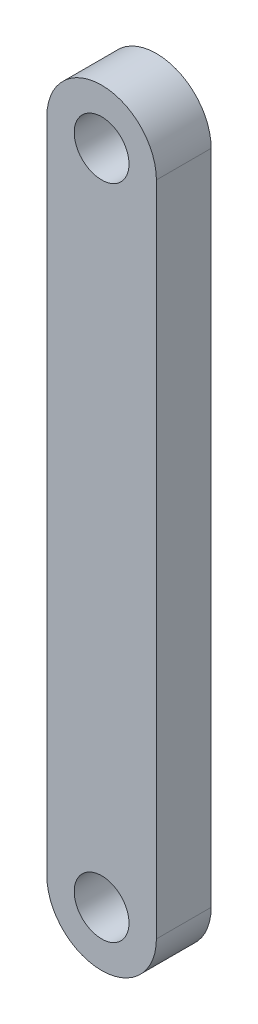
ISO-10303-21;
HEADER;
FILE_DESCRIPTION(('STEP AP214'),'2;1');
FILE_NAME('part.step','',(''),(''),'','','');
FILE_SCHEMA(('AUTOMOTIVE_DESIGN { 1 0 10303 214 1 1 1 1 }'));
ENDSEC;
DATA;
#1=APPLICATION_CONTEXT('core data for automotive mechanical design processes');
#2=APPLICATION_PROTOCOL_DEFINITION('international standard','automotive_design',2000,#1);
#3=PRODUCT_CONTEXT('',#1,'mechanical');
#4=PRODUCT('Part','Part','',(#3));
#5=PRODUCT_RELATED_PRODUCT_CATEGORY('part','',(#4));
#6=PRODUCT_DEFINITION_FORMATION('','',#4);
#7=PRODUCT_DEFINITION_CONTEXT('part definition',#1,'design');
#8=PRODUCT_DEFINITION('design','',#6,#7);
#9=PRODUCT_DEFINITION_SHAPE('','',#8);
#10=(LENGTH_UNIT() NAMED_UNIT(*) SI_UNIT(.MILLI.,.METRE.));
#11=(NAMED_UNIT(*) PLANE_ANGLE_UNIT() SI_UNIT($,.RADIAN.));
#12=(NAMED_UNIT(*) SI_UNIT($,.STERADIAN.) SOLID_ANGLE_UNIT());
#13=UNCERTAINTY_MEASURE_WITH_UNIT(LENGTH_MEASURE(1.E-05),#10,'distance_accuracy_value','');
#14=(GEOMETRIC_REPRESENTATION_CONTEXT(3) GLOBAL_UNCERTAINTY_ASSIGNED_CONTEXT((#13)) GLOBAL_UNIT_ASSIGNED_CONTEXT((#10,
#11,#12)) REPRESENTATION_CONTEXT('',''));
#15=CARTESIAN_POINT('',(0.,0.,0.));
#16=DIRECTION('',(0.,0.,1.));
#17=DIRECTION('',(1.,0.,0.));
#18=AXIS2_PLACEMENT_3D('',#15,#16,#17);
#19=CARTESIAN_POINT('',(0.,-60.,10.));
#20=DIRECTION('',(0.,0.,-1.));
#21=DIRECTION('',(-1.,0.,0.));
#22=AXIS2_PLACEMENT_3D('',#19,#20,#21);
#23=CYLINDRICAL_SURFACE('',#22,10.);
#24=CARTESIAN_POINT('',(0.,-60.,0.));
#25=DIRECTION('',(0.,0.,1.));
#26=DIRECTION('',(1.,0.,0.));
#27=AXIS2_PLACEMENT_3D('',#24,#25,#26);
#28=CIRCLE('',#27,10.);
#29=CARTESIAN_POINT('',(-10.,-60.,0.));
#30=VERTEX_POINT('',#29);
#31=CARTESIAN_POINT('',(10.,-60.,0.));
#32=VERTEX_POINT('',#31);
#33=EDGE_CURVE('E112',#30,#32,#28,.T.);
#34=ORIENTED_EDGE('',*,*,#33,.T.);
#35=DIRECTION('',(0.,0.,-1.));
#36=VECTOR('',#35,1.);
#37=CARTESIAN_POINT('',(10.,-60.,10.));
#38=LINE('',#37,#36);
#39=CARTESIAN_POINT('',(10.,-60.,10.));
#40=VERTEX_POINT('',#39);
#41=EDGE_CURVE('E11',#40,#32,#38,.T.);
#42=ORIENTED_EDGE('',*,*,#41,.F.);
#43=CARTESIAN_POINT('',(0.,-60.,10.));
#44=DIRECTION('',(0.,0.,1.));
#45=DIRECTION('',(1.,0.,0.));
#46=AXIS2_PLACEMENT_3D('',#43,#44,#45);
#47=CIRCLE('',#46,10.);
#48=CARTESIAN_POINT('',(-10.,-60.,10.));
#49=VERTEX_POINT('',#48);
#50=EDGE_CURVE('E96',#49,#40,#47,.T.);
#51=ORIENTED_EDGE('',*,*,#50,.F.);
#52=DIRECTION('',(0.,0.,-1.));
#53=VECTOR('',#52,1.);
#54=CARTESIAN_POINT('',(-10.,-60.,10.));
#55=LINE('',#54,#53);
#56=EDGE_CURVE('E108',#49,#30,#55,.T.);
#57=ORIENTED_EDGE('',*,*,#56,.T.);
#58=EDGE_LOOP('',(#34,#42,#51,#57));
#59=FACE_BOUND('',#58,.T.);
#60=ADVANCED_FACE('F44',(#59),#23,.T.);
#61=CARTESIAN_POINT('',(9.99999999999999,60.,10.));
#62=DIRECTION('',(-1.,0.,0.));
#63=DIRECTION('',(0.,-1.,0.));
#64=AXIS2_PLACEMENT_3D('',#61,#62,#63);
#65=PLANE('',#64);
#66=DIRECTION('',(0.,1.,0.));
#67=VECTOR('',#66,1.);
#68=CARTESIAN_POINT('',(9.99999999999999,60.,0.));
#69=LINE('',#68,#67);
#70=CARTESIAN_POINT('',(9.99999999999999,60.,0.));
#71=VERTEX_POINT('',#70);
#72=EDGE_CURVE('E101',#32,#71,#69,.T.);
#73=ORIENTED_EDGE('',*,*,#72,.T.);
#74=DIRECTION('',(0.,0.,-1.));
#75=VECTOR('',#74,1.);
#76=CARTESIAN_POINT('',(9.99999999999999,60.,10.));
#77=LINE('',#76,#75);
#78=CARTESIAN_POINT('',(9.99999999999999,60.,10.));
#79=VERTEX_POINT('',#78);
#80=EDGE_CURVE('E53',#79,#71,#77,.T.);
#81=ORIENTED_EDGE('',*,*,#80,.F.);
#82=DIRECTION('',(0.,1.,0.));
#83=VECTOR('',#82,1.);
#84=CARTESIAN_POINT('',(9.99999999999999,60.,10.));
#85=LINE('',#84,#83);
#86=EDGE_CURVE('E91',#40,#79,#85,.T.);
#87=ORIENTED_EDGE('',*,*,#86,.F.);
#88=ORIENTED_EDGE('',*,*,#41,.T.);
#89=EDGE_LOOP('',(#73,#81,#87,#88));
#90=FACE_BOUND('',#89,.T.);
#91=ADVANCED_FACE('F100',(#90),#65,.F.);
#92=CARTESIAN_POINT('',(0.,60.,10.));
#93=DIRECTION('',(0.,0.,-1.));
#94=DIRECTION('',(-1.,0.,0.));
#95=AXIS2_PLACEMENT_3D('',#92,#93,#94);
#96=CYLINDRICAL_SURFACE('',#95,10.);
#97=CARTESIAN_POINT('',(0.,60.,0.));
#98=DIRECTION('',(0.,0.,1.));
#99=DIRECTION('',(1.,0.,0.));
#100=AXIS2_PLACEMENT_3D('',#97,#98,#99);
#101=CIRCLE('',#100,10.);
#102=CARTESIAN_POINT('',(-10.,60.,0.));
#103=VERTEX_POINT('',#102);
#104=EDGE_CURVE('E78',#71,#103,#101,.T.);
#105=ORIENTED_EDGE('',*,*,#104,.T.);
#106=DIRECTION('',(0.,0.,-1.));
#107=VECTOR('',#106,1.);
#108=CARTESIAN_POINT('',(-10.,60.,10.));
#109=LINE('',#108,#107);
#110=CARTESIAN_POINT('',(-10.,60.,10.));
#111=VERTEX_POINT('',#110);
#112=EDGE_CURVE('E103',#111,#103,#109,.T.);
#113=ORIENTED_EDGE('',*,*,#112,.F.);
#114=CARTESIAN_POINT('',(0.,60.,10.));
#115=DIRECTION('',(0.,0.,1.));
#116=DIRECTION('',(1.,0.,0.));
#117=AXIS2_PLACEMENT_3D('',#114,#115,#116);
#118=CIRCLE('',#117,10.);
#119=EDGE_CURVE('E94',#79,#111,#118,.T.);
#120=ORIENTED_EDGE('',*,*,#119,.F.);
#121=ORIENTED_EDGE('',*,*,#80,.T.);
#122=EDGE_LOOP('',(#105,#113,#120,#121));
#123=FACE_BOUND('',#122,.T.);
#124=ADVANCED_FACE('F104',(#123),#96,.T.);
#125=CARTESIAN_POINT('',(-10.,60.,10.));
#126=DIRECTION('',(1.,0.,0.));
#127=DIRECTION('',(0.,1.,0.));
#128=AXIS2_PLACEMENT_3D('',#125,#126,#127);
#129=PLANE('',#128);
#130=DIRECTION('',(0.,-1.,0.));
#131=VECTOR('',#130,1.);
#132=CARTESIAN_POINT('',(-10.,60.,0.));
#133=LINE('',#132,#131);
#134=EDGE_CURVE('E84',#103,#30,#133,.T.);
#135=ORIENTED_EDGE('',*,*,#134,.T.);
#136=ORIENTED_EDGE('',*,*,#56,.F.);
#137=DIRECTION('',(0.,-1.,0.));
#138=VECTOR('',#137,1.);
#139=CARTESIAN_POINT('',(-10.,60.,10.));
#140=LINE('',#139,#138);
#141=EDGE_CURVE('E61',#111,#49,#140,.T.);
#142=ORIENTED_EDGE('',*,*,#141,.F.);
#143=ORIENTED_EDGE('',*,*,#112,.T.);
#144=EDGE_LOOP('',(#135,#136,#142,#143));
#145=FACE_BOUND('',#144,.T.);
#146=ADVANCED_FACE('F126',(#145),#129,.F.);
#147=CARTESIAN_POINT('',(0.,-60.,10.));
#148=DIRECTION('',(0.,0.,1.));
#149=DIRECTION('',(1.,0.,0.));
#150=AXIS2_PLACEMENT_3D('',#147,#148,#149);
#151=PLANE('',#150);
#152=CARTESIAN_POINT('',(0.,60.,10.));
#153=DIRECTION('',(0.,0.,1.));
#154=DIRECTION('',(1.,0.,0.));
#155=AXIS2_PLACEMENT_3D('',#152,#153,#154);
#156=CIRCLE('',#155,5.);
#157=CARTESIAN_POINT('',(4.99999999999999,60.,10.));
#158=VERTEX_POINT('',#157);
#159=EDGE_CURVE('E116',#158,#158,#156,.T.);
#160=ORIENTED_EDGE('',*,*,#159,.F.);
#161=EDGE_LOOP('',(#160));
#162=FACE_BOUND('',#161,.T.);
#163=CARTESIAN_POINT('',(0.,-60.,10.));
#164=DIRECTION('',(0.,0.,1.));
#165=DIRECTION('',(1.,0.,0.));
#166=AXIS2_PLACEMENT_3D('',#163,#164,#165);
#167=CIRCLE('',#166,5.);
#168=CARTESIAN_POINT('',(5.,-60.,10.));
#169=VERTEX_POINT('',#168);
#170=EDGE_CURVE('E133',#169,#169,#167,.T.);
#171=ORIENTED_EDGE('',*,*,#170,.F.);
#172=EDGE_LOOP('',(#171));
#173=FACE_BOUND('',#172,.T.);
#174=ORIENTED_EDGE('',*,*,#50,.T.);
#175=ORIENTED_EDGE('',*,*,#86,.T.);
#176=ORIENTED_EDGE('',*,*,#119,.T.);
#177=ORIENTED_EDGE('',*,*,#141,.T.);
#178=EDGE_LOOP('',(#174,#175,#176,#177));
#179=FACE_BOUND('',#178,.T.);
#180=ADVANCED_FACE('F92',(#162,#173,#179),#151,.T.);
#181=CARTESIAN_POINT('',(0.,-60.,0.));
#182=DIRECTION('',(0.,0.,1.));
#183=DIRECTION('',(1.,0.,0.));
#184=AXIS2_PLACEMENT_3D('',#181,#182,#183);
#185=PLANE('',#184);
#186=CARTESIAN_POINT('',(0.,60.,0.));
#187=DIRECTION('',(0.,0.,1.));
#188=DIRECTION('',(1.,0.,0.));
#189=AXIS2_PLACEMENT_3D('',#186,#187,#188);
#190=CIRCLE('',#189,5.);
#191=CARTESIAN_POINT('',(4.99999999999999,60.,0.));
#192=VERTEX_POINT('',#191);
#193=EDGE_CURVE('E141',#192,#192,#190,.T.);
#194=ORIENTED_EDGE('',*,*,#193,.T.);
#195=EDGE_LOOP('',(#194));
#196=FACE_BOUND('',#195,.T.);
#197=CARTESIAN_POINT('',(0.,-60.,0.));
#198=DIRECTION('',(0.,0.,1.));
#199=DIRECTION('',(1.,0.,0.));
#200=AXIS2_PLACEMENT_3D('',#197,#198,#199);
#201=CIRCLE('',#200,5.);
#202=CARTESIAN_POINT('',(5.,-60.,0.));
#203=VERTEX_POINT('',#202);
#204=EDGE_CURVE('E137',#203,#203,#201,.T.);
#205=ORIENTED_EDGE('',*,*,#204,.T.);
#206=EDGE_LOOP('',(#205));
#207=FACE_BOUND('',#206,.T.);
#208=ORIENTED_EDGE('',*,*,#33,.F.);
#209=ORIENTED_EDGE('',*,*,#134,.F.);
#210=ORIENTED_EDGE('',*,*,#104,.F.);
#211=ORIENTED_EDGE('',*,*,#72,.F.);
#212=EDGE_LOOP('',(#208,#209,#210,#211));
#213=FACE_BOUND('',#212,.T.);
#214=ADVANCED_FACE('F129',(#196,#207,#213),#185,.F.);
#215=CARTESIAN_POINT('',(0.,-60.,10.));
#216=DIRECTION('',(0.,0.,-1.));
#217=DIRECTION('',(-1.,0.,0.));
#218=AXIS2_PLACEMENT_3D('',#215,#216,#217);
#219=CYLINDRICAL_SURFACE('',#218,5.);
#220=ORIENTED_EDGE('',*,*,#170,.T.);
#221=EDGE_LOOP('',(#220));
#222=FACE_BOUND('',#221,.T.);
#223=ORIENTED_EDGE('',*,*,#204,.F.);
#224=EDGE_LOOP('',(#223));
#225=FACE_BOUND('',#224,.T.);
#226=ADVANCED_FACE('F157',(#222,#225),#219,.F.);
#227=CARTESIAN_POINT('',(0.,60.,10.));
#228=DIRECTION('',(0.,0.,-1.));
#229=DIRECTION('',(-1.,0.,0.));
#230=AXIS2_PLACEMENT_3D('',#227,#228,#229);
#231=CYLINDRICAL_SURFACE('',#230,5.);
#232=ORIENTED_EDGE('',*,*,#159,.T.);
#233=EDGE_LOOP('',(#232));
#234=FACE_BOUND('',#233,.T.);
#235=ORIENTED_EDGE('',*,*,#193,.F.);
#236=EDGE_LOOP('',(#235));
#237=FACE_BOUND('',#236,.T.);
#238=ADVANCED_FACE('F149',(#234,#237),#231,.F.);
#239=CLOSED_SHELL('',(#60,#91,#124,#146,#180,#214,#226,#238));
#240=MANIFOLD_SOLID_BREP('B2',#239);
#241=ADVANCED_BREP_SHAPE_REPRESENTATION('',(#18,#240),#14);
#242=SHAPE_DEFINITION_REPRESENTATION(#9,#241);
ENDSEC;
END-ISO-10303-21;
